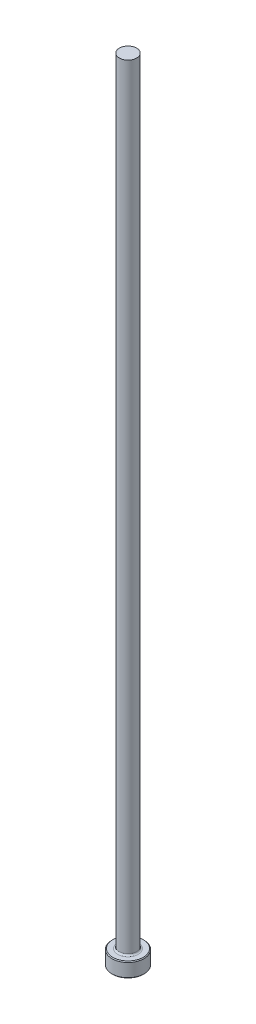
ISO-10303-21;
HEADER;
FILE_DESCRIPTION(('STEP AP214'),'2;1');
FILE_NAME('part.step','',(''),(''),'','','');
FILE_SCHEMA(('AUTOMOTIVE_DESIGN { 1 0 10303 214 1 1 1 1 }'));
ENDSEC;
DATA;
#1=APPLICATION_CONTEXT('core data for automotive mechanical design processes');
#2=APPLICATION_PROTOCOL_DEFINITION('international standard','automotive_design',2000,#1);
#3=PRODUCT_CONTEXT('',#1,'mechanical');
#4=PRODUCT('Part','Part','',(#3));
#5=PRODUCT_RELATED_PRODUCT_CATEGORY('part','',(#4));
#6=PRODUCT_DEFINITION_FORMATION('','',#4);
#7=PRODUCT_DEFINITION_CONTEXT('part definition',#1,'design');
#8=PRODUCT_DEFINITION('design','',#6,#7);
#9=PRODUCT_DEFINITION_SHAPE('','',#8);
#10=(LENGTH_UNIT() NAMED_UNIT(*) SI_UNIT(.MILLI.,.METRE.));
#11=(NAMED_UNIT(*) PLANE_ANGLE_UNIT() SI_UNIT($,.RADIAN.));
#12=(NAMED_UNIT(*) SI_UNIT($,.STERADIAN.) SOLID_ANGLE_UNIT());
#13=UNCERTAINTY_MEASURE_WITH_UNIT(LENGTH_MEASURE(1.E-05),#10,'distance_accuracy_value','');
#14=(GEOMETRIC_REPRESENTATION_CONTEXT(3) GLOBAL_UNCERTAINTY_ASSIGNED_CONTEXT((#13)) GLOBAL_UNIT_ASSIGNED_CONTEXT((#10,
#11,#12)) REPRESENTATION_CONTEXT('',''));
#15=CARTESIAN_POINT('',(0.,0.,0.));
#16=DIRECTION('',(0.,0.,1.));
#17=DIRECTION('',(1.,0.,0.));
#18=AXIS2_PLACEMENT_3D('',#15,#16,#17);
#19=CARTESIAN_POINT('',(0.,0.,0.));
#20=DIRECTION('',(0.,-1.,0.));
#21=DIRECTION('',(0.,0.,-1.));
#22=AXIS2_PLACEMENT_3D('',#19,#20,#21);
#23=PLANE('',#22);
#24=CARTESIAN_POINT('',(0.,0.,0.));
#25=DIRECTION('',(0.,-1.,0.));
#26=DIRECTION('',(0.,0.,-1.));
#27=AXIS2_PLACEMENT_3D('',#24,#25,#26);
#28=CIRCLE('',#27,4.9022);
#29=CARTESIAN_POINT('',(0.,0.,-4.9022));
#30=VERTEX_POINT('',#29);
#31=EDGE_CURVE('E46',#30,#30,#28,.T.);
#32=ORIENTED_EDGE('',*,*,#31,.T.);
#33=EDGE_LOOP('',(#32));
#34=FACE_BOUND('',#33,.T.);
#35=ADVANCED_FACE('F35',(#34),#23,.T.);
#36=CARTESIAN_POINT('',(0.,259.958771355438,0.));
#37=DIRECTION('',(0.,1.,0.));
#38=DIRECTION('',(0.,0.,1.));
#39=AXIS2_PLACEMENT_3D('',#36,#37,#38);
#40=CYLINDRICAL_SURFACE('',#39,5.15619999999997);
#41=CARTESIAN_POINT('',(0.,4.49579999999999,0.));
#42=DIRECTION('',(0.,1.,0.));
#43=DIRECTION('',(0.,0.,1.));
#44=AXIS2_PLACEMENT_3D('',#41,#42,#43);
#45=CIRCLE('',#44,5.15619999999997);
#46=CARTESIAN_POINT('',(0.,4.49579999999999,5.15619999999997));
#47=VERTEX_POINT('',#46);
#48=EDGE_CURVE('E50',#47,#47,#45,.F.);
#49=ORIENTED_EDGE('',*,*,#48,.T.);
#50=EDGE_LOOP('',(#49));
#51=FACE_BOUND('',#50,.T.);
#52=CARTESIAN_POINT('',(0.,0.253999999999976,0.));
#53=DIRECTION('',(0.,-1.,0.));
#54=DIRECTION('',(0.,0.,-1.));
#55=AXIS2_PLACEMENT_3D('',#52,#53,#54);
#56=CIRCLE('',#55,5.15619999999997);
#57=CARTESIAN_POINT('',(0.,0.253999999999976,-5.15619999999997));
#58=VERTEX_POINT('',#57);
#59=EDGE_CURVE('E55',#58,#58,#56,.F.);
#60=ORIENTED_EDGE('',*,*,#59,.T.);
#61=EDGE_LOOP('',(#60));
#62=FACE_BOUND('',#61,.T.);
#63=ADVANCED_FACE('F77',(#51,#62),#40,.T.);
#64=CARTESIAN_POINT('',(-5.15619999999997,4.7498,0.));
#65=DIRECTION('',(0.,1.,0.));
#66=DIRECTION('',(0.,0.,1.));
#67=AXIS2_PLACEMENT_3D('',#64,#65,#66);
#68=PLANE('',#67);
#69=CARTESIAN_POINT('',(0.,4.7498,0.));
#70=DIRECTION('',(0.,1.,0.));
#71=DIRECTION('',(0.,0.,1.));
#72=AXIS2_PLACEMENT_3D('',#69,#70,#71);
#73=CIRCLE('',#72,3.28548999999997);
#74=CARTESIAN_POINT('',(0.,4.7498,3.28548999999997));
#75=VERTEX_POINT('',#74);
#76=EDGE_CURVE('E10',#75,#75,#73,.F.);
#77=ORIENTED_EDGE('',*,*,#76,.T.);
#78=EDGE_LOOP('',(#77));
#79=FACE_BOUND('',#78,.T.);
#80=CARTESIAN_POINT('',(0.,4.7498,0.));
#81=DIRECTION('',(0.,1.,0.));
#82=DIRECTION('',(0.,0.,1.));
#83=AXIS2_PLACEMENT_3D('',#80,#81,#82);
#84=CIRCLE('',#83,4.90220000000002);
#85=CARTESIAN_POINT('',(0.,4.7498,4.90220000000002));
#86=VERTEX_POINT('',#85);
#87=EDGE_CURVE('E58',#86,#86,#84,.T.);
#88=ORIENTED_EDGE('',*,*,#87,.T.);
#89=EDGE_LOOP('',(#88));
#90=FACE_BOUND('',#89,.T.);
#91=ADVANCED_FACE('F69',(#79,#90),#68,.T.);
#92=CARTESIAN_POINT('',(0.,259.958771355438,0.));
#93=DIRECTION('',(0.,1.,0.));
#94=DIRECTION('',(0.,0.,1.));
#95=AXIS2_PLACEMENT_3D('',#92,#93,#94);
#96=CYLINDRICAL_SURFACE('',#95,2.77748999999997);
#97=CARTESIAN_POINT('',(0.,5.25779999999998,0.));
#98=DIRECTION('',(0.,1.,0.));
#99=DIRECTION('',(0.,0.,1.));
#100=AXIS2_PLACEMENT_3D('',#97,#98,#99);
#101=CIRCLE('',#100,2.77748999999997);
#102=CARTESIAN_POINT('',(0.,5.25779999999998,2.77748999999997));
#103=VERTEX_POINT('',#102);
#104=EDGE_CURVE('E42',#103,#103,#101,.T.);
#105=ORIENTED_EDGE('',*,*,#104,.T.);
#106=EDGE_LOOP('',(#105));
#107=FACE_BOUND('',#106,.T.);
#108=CARTESIAN_POINT('',(0.,254.,0.));
#109=DIRECTION('',(0.,1.,0.));
#110=DIRECTION('',(0.,0.,1.));
#111=AXIS2_PLACEMENT_3D('',#108,#109,#110);
#112=CIRCLE('',#111,2.77748999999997);
#113=CARTESIAN_POINT('',(0.,254.,2.77748999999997));
#114=VERTEX_POINT('',#113);
#115=EDGE_CURVE('E61',#114,#114,#112,.T.);
#116=ORIENTED_EDGE('',*,*,#115,.F.);
#117=EDGE_LOOP('',(#116));
#118=FACE_BOUND('',#117,.T.);
#119=ADVANCED_FACE('F67',(#107,#118),#96,.T.);
#120=CARTESIAN_POINT('',(-2.77748999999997,254.,0.));
#121=DIRECTION('',(0.,1.,0.));
#122=DIRECTION('',(0.,0.,1.));
#123=AXIS2_PLACEMENT_3D('',#120,#121,#122);
#124=PLANE('',#123);
#125=ORIENTED_EDGE('',*,*,#115,.T.);
#126=EDGE_LOOP('',(#125));
#127=FACE_BOUND('',#126,.T.);
#128=ADVANCED_FACE('F65',(#127),#124,.T.);
#129=CARTESIAN_POINT('',(0.,4.74980000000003,0.));
#130=DIRECTION('',(0.,-1.,0.));
#131=DIRECTION('',(0.,0.,-1.));
#132=AXIS2_PLACEMENT_3D('',#129,#130,#131);
#133=CONICAL_SURFACE('',#132,4.9022,0.785398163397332);
#134=ORIENTED_EDGE('',*,*,#48,.F.);
#135=EDGE_LOOP('',(#134));
#136=FACE_BOUND('',#135,.T.);
#137=ORIENTED_EDGE('',*,*,#87,.F.);
#138=EDGE_LOOP('',(#137));
#139=FACE_BOUND('',#138,.T.);
#140=ADVANCED_FACE('F75',(#136,#139),#133,.T.);
#141=CARTESIAN_POINT('',(0.,0.253999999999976,0.));
#142=DIRECTION('',(0.,1.,0.));
#143=DIRECTION('',(0.,0.,1.));
#144=AXIS2_PLACEMENT_3D('',#141,#142,#143);
#145=CONICAL_SURFACE('',#144,5.15619999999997,0.785398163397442);
#146=ORIENTED_EDGE('',*,*,#31,.F.);
#147=EDGE_LOOP('',(#146));
#148=FACE_BOUND('',#147,.T.);
#149=ORIENTED_EDGE('',*,*,#59,.F.);
#150=EDGE_LOOP('',(#149));
#151=FACE_BOUND('',#150,.T.);
#152=ADVANCED_FACE('F89',(#148,#151),#145,.T.);
#153=CARTESIAN_POINT('',(0.,5.25779999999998,0.));
#154=DIRECTION('',(0.,1.,0.));
#155=DIRECTION('',(0.,0.,1.));
#156=AXIS2_PLACEMENT_3D('',#153,#154,#155);
#157=TOROIDAL_SURFACE('',#156,3.28548999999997,0.508);
#158=ORIENTED_EDGE('',*,*,#76,.F.);
#159=EDGE_LOOP('',(#158));
#160=FACE_BOUND('',#159,.T.);
#161=ORIENTED_EDGE('',*,*,#104,.F.);
#162=EDGE_LOOP('',(#161));
#163=FACE_BOUND('',#162,.T.);
#164=ADVANCED_FACE('F37',(#160,#163),#157,.F.);
#165=CLOSED_SHELL('',(#35,#63,#91,#119,#128,#140,#152,#164));
#166=MANIFOLD_SOLID_BREP('B2',#165);
#167=ADVANCED_BREP_SHAPE_REPRESENTATION('',(#18,#166),#14);
#168=SHAPE_DEFINITION_REPRESENTATION(#9,#167);
ENDSEC;
END-ISO-10303-21;
